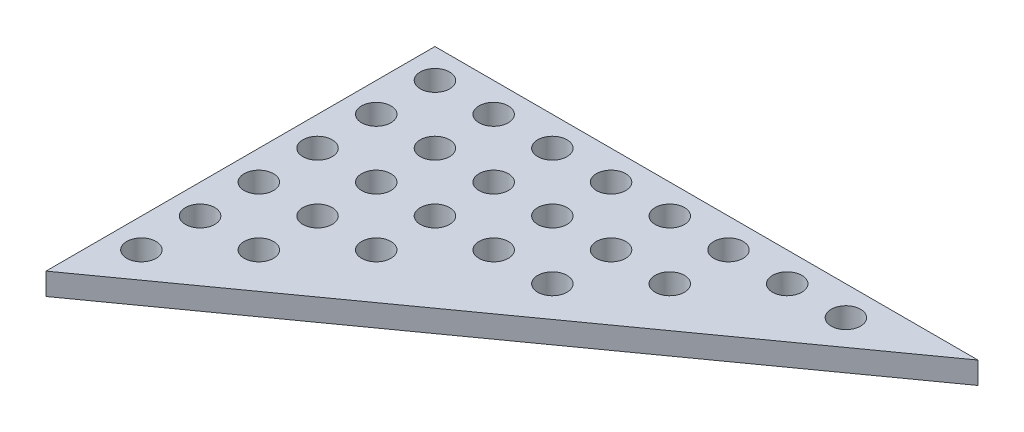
ISO-10303-21;
HEADER;
FILE_DESCRIPTION(('STEP AP214'),'2;1');
FILE_NAME('part.step','',(''),(''),'','','');
FILE_SCHEMA(('AUTOMOTIVE_DESIGN { 1 0 10303 214 1 1 1 1 }'));
ENDSEC;
DATA;
#1=APPLICATION_CONTEXT('core data for automotive mechanical design processes');
#2=APPLICATION_PROTOCOL_DEFINITION('international standard','automotive_design',2000,#1);
#3=PRODUCT_CONTEXT('',#1,'mechanical');
#4=PRODUCT('Part','Part','',(#3));
#5=PRODUCT_RELATED_PRODUCT_CATEGORY('part','',(#4));
#6=PRODUCT_DEFINITION_FORMATION('','',#4);
#7=PRODUCT_DEFINITION_CONTEXT('part definition',#1,'design');
#8=PRODUCT_DEFINITION('design','',#6,#7);
#9=PRODUCT_DEFINITION_SHAPE('','',#8);
#10=(LENGTH_UNIT() NAMED_UNIT(*) SI_UNIT(.MILLI.,.METRE.));
#11=(NAMED_UNIT(*) PLANE_ANGLE_UNIT() SI_UNIT($,.RADIAN.));
#12=(NAMED_UNIT(*) SI_UNIT($,.STERADIAN.) SOLID_ANGLE_UNIT());
#13=UNCERTAINTY_MEASURE_WITH_UNIT(LENGTH_MEASURE(1.E-05),#10,'distance_accuracy_value','');
#14=(GEOMETRIC_REPRESENTATION_CONTEXT(3) GLOBAL_UNCERTAINTY_ASSIGNED_CONTEXT((#13)) GLOBAL_UNIT_ASSIGNED_CONTEXT((#10,
#11,#12)) REPRESENTATION_CONTEXT('',''));
#15=CARTESIAN_POINT('',(0.,0.,0.));
#16=DIRECTION('',(0.,0.,1.));
#17=DIRECTION('',(1.,0.,0.));
#18=AXIS2_PLACEMENT_3D('',#15,#16,#17);
#19=CARTESIAN_POINT('',(0.,3.,0.));
#20=DIRECTION('',(0.,1.,0.));
#21=DIRECTION('',(0.,0.,1.));
#22=AXIS2_PLACEMENT_3D('',#19,#20,#21);
#23=PLANE('',#22);
#24=CARTESIAN_POINT('',(-49.9437499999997,3.,1.053125));
#25=DIRECTION('',(0.,1.,0.));
#26=DIRECTION('',(0.,0.,1.));
#27=AXIS2_PLACEMENT_3D('',#24,#25,#26);
#28=CIRCLE('',#27,2.);
#29=CARTESIAN_POINT('',(-49.9437499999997,3.,3.053125));
#30=VERTEX_POINT('',#29);
#31=EDGE_CURVE('E204',#30,#30,#28,.T.);
#32=ORIENTED_EDGE('',*,*,#31,.F.);
#33=EDGE_LOOP('',(#32));
#34=FACE_BOUND('',#33,.T.);
#35=CARTESIAN_POINT('',(-49.9437499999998,3.,-6.946875));
#36=DIRECTION('',(0.,1.,0.));
#37=DIRECTION('',(0.,0.,1.));
#38=AXIS2_PLACEMENT_3D('',#35,#36,#37);
#39=CIRCLE('',#38,2.);
#40=CARTESIAN_POINT('',(-49.9437499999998,3.,-4.946875));
#41=VERTEX_POINT('',#40);
#42=EDGE_CURVE('E212',#41,#41,#39,.T.);
#43=ORIENTED_EDGE('',*,*,#42,.F.);
#44=EDGE_LOOP('',(#43));
#45=FACE_BOUND('',#44,.T.);
#46=CARTESIAN_POINT('',(-49.9437499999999,3.,-14.946875));
#47=DIRECTION('',(0.,1.,0.));
#48=DIRECTION('',(0.,0.,1.));
#49=AXIS2_PLACEMENT_3D('',#46,#47,#48);
#50=CIRCLE('',#49,2.);
#51=CARTESIAN_POINT('',(-49.9437499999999,3.,-12.946875));
#52=VERTEX_POINT('',#51);
#53=EDGE_CURVE('E220',#52,#52,#50,.T.);
#54=ORIENTED_EDGE('',*,*,#53,.F.);
#55=EDGE_LOOP('',(#54));
#56=FACE_BOUND('',#55,.T.);
#57=CARTESIAN_POINT('',(-17.94375,3.,-22.946875));
#58=DIRECTION('',(0.,1.,0.));
#59=DIRECTION('',(0.,0.,1.));
#60=AXIS2_PLACEMENT_3D('',#57,#58,#59);
#61=CIRCLE('',#60,2.);
#62=CARTESIAN_POINT('',(-17.94375,3.,-20.946875));
#63=VERTEX_POINT('',#62);
#64=EDGE_CURVE('E228',#63,#63,#61,.T.);
#65=ORIENTED_EDGE('',*,*,#64,.F.);
#66=EDGE_LOOP('',(#65));
#67=FACE_BOUND('',#66,.T.);
#68=CARTESIAN_POINT('',(-33.94375,3.,-22.946875));
#69=DIRECTION('',(0.,1.,0.));
#70=DIRECTION('',(0.,0.,1.));
#71=AXIS2_PLACEMENT_3D('',#68,#69,#70);
#72=CIRCLE('',#71,2.);
#73=CARTESIAN_POINT('',(-33.94375,3.,-20.946875));
#74=VERTEX_POINT('',#73);
#75=EDGE_CURVE('E236',#74,#74,#72,.T.);
#76=ORIENTED_EDGE('',*,*,#75,.F.);
#77=EDGE_LOOP('',(#76));
#78=FACE_BOUND('',#77,.T.);
#79=CARTESIAN_POINT('',(-49.94375,3.,-22.946875));
#80=DIRECTION('',(0.,1.,0.));
#81=DIRECTION('',(0.,0.,1.));
#82=AXIS2_PLACEMENT_3D('',#79,#80,#81);
#83=CIRCLE('',#82,2.);
#84=CARTESIAN_POINT('',(-49.94375,3.,-20.946875));
#85=VERTEX_POINT('',#84);
#86=EDGE_CURVE('E244',#85,#85,#83,.T.);
#87=ORIENTED_EDGE('',*,*,#86,.F.);
#88=EDGE_LOOP('',(#87));
#89=FACE_BOUND('',#88,.T.);
#90=CARTESIAN_POINT('',(-57.9437499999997,3.,1.053125));
#91=DIRECTION('',(0.,1.,0.));
#92=DIRECTION('',(0.,0.,1.));
#93=AXIS2_PLACEMENT_3D('',#90,#91,#92);
#94=CIRCLE('',#93,2.);
#95=CARTESIAN_POINT('',(-57.9437499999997,3.,3.053125));
#96=VERTEX_POINT('',#95);
#97=EDGE_CURVE('E252',#96,#96,#94,.T.);
#98=ORIENTED_EDGE('',*,*,#97,.F.);
#99=EDGE_LOOP('',(#98));
#100=FACE_BOUND('',#99,.T.);
#101=CARTESIAN_POINT('',(-57.9437499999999,3.,-14.946875));
#102=DIRECTION('',(0.,1.,0.));
#103=DIRECTION('',(0.,0.,1.));
#104=AXIS2_PLACEMENT_3D('',#101,#102,#103);
#105=CIRCLE('',#104,2.);
#106=CARTESIAN_POINT('',(-57.9437499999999,3.,-12.946875));
#107=VERTEX_POINT('',#106);
#108=EDGE_CURVE('E260',#107,#107,#105,.T.);
#109=ORIENTED_EDGE('',*,*,#108,.F.);
#110=EDGE_LOOP('',(#109));
#111=FACE_BOUND('',#110,.T.);
#112=CARTESIAN_POINT('',(-1.94375000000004,3.,-30.946875));
#113=DIRECTION('',(0.,1.,0.));
#114=DIRECTION('',(0.,0.,1.));
#115=AXIS2_PLACEMENT_3D('',#112,#113,#114);
#116=CIRCLE('',#115,2.);
#117=CARTESIAN_POINT('',(-1.94375000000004,3.,-28.946875));
#118=VERTEX_POINT('',#117);
#119=EDGE_CURVE('E268',#118,#118,#116,.T.);
#120=ORIENTED_EDGE('',*,*,#119,.F.);
#121=EDGE_LOOP('',(#120));
#122=FACE_BOUND('',#121,.T.);
#123=CARTESIAN_POINT('',(-17.94375,3.,-30.946875));
#124=DIRECTION('',(0.,1.,0.));
#125=DIRECTION('',(0.,0.,1.));
#126=AXIS2_PLACEMENT_3D('',#123,#124,#125);
#127=CIRCLE('',#126,2.);
#128=CARTESIAN_POINT('',(-17.94375,3.,-28.946875));
#129=VERTEX_POINT('',#128);
#130=EDGE_CURVE('E276',#129,#129,#127,.T.);
#131=ORIENTED_EDGE('',*,*,#130,.F.);
#132=EDGE_LOOP('',(#131));
#133=FACE_BOUND('',#132,.T.);
#134=CARTESIAN_POINT('',(-33.94375,3.,-30.946875));
#135=DIRECTION('',(0.,1.,0.));
#136=DIRECTION('',(0.,0.,1.));
#137=AXIS2_PLACEMENT_3D('',#134,#135,#136);
#138=CIRCLE('',#137,2.);
#139=CARTESIAN_POINT('',(-33.94375,3.,-28.946875));
#140=VERTEX_POINT('',#139);
#141=EDGE_CURVE('E284',#140,#140,#138,.T.);
#142=ORIENTED_EDGE('',*,*,#141,.F.);
#143=EDGE_LOOP('',(#142));
#144=FACE_BOUND('',#143,.T.);
#145=CARTESIAN_POINT('',(-49.94375,3.,-30.946875));
#146=DIRECTION('',(0.,1.,0.));
#147=DIRECTION('',(0.,0.,1.));
#148=AXIS2_PLACEMENT_3D('',#145,#146,#147);
#149=CIRCLE('',#148,2.);
#150=CARTESIAN_POINT('',(-49.94375,3.,-28.946875));
#151=VERTEX_POINT('',#150);
#152=EDGE_CURVE('E292',#151,#151,#149,.T.);
#153=ORIENTED_EDGE('',*,*,#152,.F.);
#154=EDGE_LOOP('',(#153));
#155=FACE_BOUND('',#154,.T.);
#156=DIRECTION('',(-1.,0.,0.));
#157=VECTOR('',#156,1.);
#158=CARTESIAN_POINT('',(12.05625,3.,-34.946875));
#159=LINE('',#158,#157);
#160=CARTESIAN_POINT('',(12.05625,3.,-34.946875));
#161=VERTEX_POINT('',#160);
#162=CARTESIAN_POINT('',(-61.94375,3.,-34.946875));
#163=VERTEX_POINT('',#162);
#164=EDGE_CURVE('E76',#161,#163,#159,.T.);
#165=ORIENTED_EDGE('',*,*,#164,.T.);
#166=DIRECTION('',(0.,0.,1.));
#167=VECTOR('',#166,1.);
#168=CARTESIAN_POINT('',(-61.94375,3.,-34.946875));
#169=LINE('',#168,#167);
#170=CARTESIAN_POINT('',(-61.94375,3.,18.053125));
#171=VERTEX_POINT('',#170);
#172=EDGE_CURVE('E72',#163,#171,#169,.T.);
#173=ORIENTED_EDGE('',*,*,#172,.T.);
#174=DIRECTION('',(0.812990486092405,0.,-0.582276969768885));
#175=VECTOR('',#174,1.);
#176=CARTESIAN_POINT('',(-61.94375,3.,18.053125));
#177=LINE('',#176,#175);
#178=EDGE_CURVE('E52',#171,#161,#177,.T.);
#179=ORIENTED_EDGE('',*,*,#178,.T.);
#180=EDGE_LOOP('',(#165,#173,#179));
#181=FACE_BOUND('',#180,.T.);
#182=CARTESIAN_POINT('',(-57.94375,3.,-30.946875));
#183=DIRECTION('',(0.,1.,0.));
#184=DIRECTION('',(0.,0.,1.));
#185=AXIS2_PLACEMENT_3D('',#182,#183,#184);
#186=CIRCLE('',#185,2.);
#187=CARTESIAN_POINT('',(-57.94375,3.,-28.946875));
#188=VERTEX_POINT('',#187);
#189=EDGE_CURVE('E86',#188,#188,#186,.T.);
#190=ORIENTED_EDGE('',*,*,#189,.F.);
#191=EDGE_LOOP('',(#190));
#192=FACE_BOUND('',#191,.T.);
#193=CARTESIAN_POINT('',(-41.94375,3.,-30.946875));
#194=DIRECTION('',(0.,1.,0.));
#195=DIRECTION('',(0.,0.,1.));
#196=AXIS2_PLACEMENT_3D('',#193,#194,#195);
#197=CIRCLE('',#196,2.);
#198=CARTESIAN_POINT('',(-41.94375,3.,-28.946875));
#199=VERTEX_POINT('',#198);
#200=EDGE_CURVE('E288',#199,#199,#197,.T.);
#201=ORIENTED_EDGE('',*,*,#200,.F.);
#202=EDGE_LOOP('',(#201));
#203=FACE_BOUND('',#202,.T.);
#204=CARTESIAN_POINT('',(-25.94375,3.,-30.946875));
#205=DIRECTION('',(0.,1.,0.));
#206=DIRECTION('',(0.,0.,1.));
#207=AXIS2_PLACEMENT_3D('',#204,#205,#206);
#208=CIRCLE('',#207,2.);
#209=CARTESIAN_POINT('',(-25.94375,3.,-28.946875));
#210=VERTEX_POINT('',#209);
#211=EDGE_CURVE('E280',#210,#210,#208,.T.);
#212=ORIENTED_EDGE('',*,*,#211,.F.);
#213=EDGE_LOOP('',(#212));
#214=FACE_BOUND('',#213,.T.);
#215=CARTESIAN_POINT('',(-9.94375000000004,3.,-30.946875));
#216=DIRECTION('',(0.,1.,0.));
#217=DIRECTION('',(0.,0.,1.));
#218=AXIS2_PLACEMENT_3D('',#215,#216,#217);
#219=CIRCLE('',#218,2.);
#220=CARTESIAN_POINT('',(-9.94375000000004,3.,-28.946875));
#221=VERTEX_POINT('',#220);
#222=EDGE_CURVE('E272',#221,#221,#219,.T.);
#223=ORIENTED_EDGE('',*,*,#222,.F.);
#224=EDGE_LOOP('',(#223));
#225=FACE_BOUND('',#224,.T.);
#226=CARTESIAN_POINT('',(-57.94375,3.,-22.946875));
#227=DIRECTION('',(0.,1.,0.));
#228=DIRECTION('',(0.,0.,1.));
#229=AXIS2_PLACEMENT_3D('',#226,#227,#228);
#230=CIRCLE('',#229,2.);
#231=CARTESIAN_POINT('',(-57.94375,3.,-20.946875));
#232=VERTEX_POINT('',#231);
#233=EDGE_CURVE('E264',#232,#232,#230,.T.);
#234=ORIENTED_EDGE('',*,*,#233,.F.);
#235=EDGE_LOOP('',(#234));
#236=FACE_BOUND('',#235,.T.);
#237=CARTESIAN_POINT('',(-57.9437499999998,3.,-6.946875));
#238=DIRECTION('',(0.,1.,0.));
#239=DIRECTION('',(0.,0.,1.));
#240=AXIS2_PLACEMENT_3D('',#237,#238,#239);
#241=CIRCLE('',#240,2.);
#242=CARTESIAN_POINT('',(-57.9437499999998,3.,-4.946875));
#243=VERTEX_POINT('',#242);
#244=EDGE_CURVE('E256',#243,#243,#241,.T.);
#245=ORIENTED_EDGE('',*,*,#244,.F.);
#246=EDGE_LOOP('',(#245));
#247=FACE_BOUND('',#246,.T.);
#248=CARTESIAN_POINT('',(-57.9437499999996,3.,9.053125));
#249=DIRECTION('',(0.,1.,0.));
#250=DIRECTION('',(0.,0.,1.));
#251=AXIS2_PLACEMENT_3D('',#248,#249,#250);
#252=CIRCLE('',#251,2.);
#253=CARTESIAN_POINT('',(-57.9437499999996,3.,11.053125));
#254=VERTEX_POINT('',#253);
#255=EDGE_CURVE('E248',#254,#254,#252,.T.);
#256=ORIENTED_EDGE('',*,*,#255,.F.);
#257=EDGE_LOOP('',(#256));
#258=FACE_BOUND('',#257,.T.);
#259=CARTESIAN_POINT('',(-41.94375,3.,-22.946875));
#260=DIRECTION('',(0.,1.,0.));
#261=DIRECTION('',(0.,0.,1.));
#262=AXIS2_PLACEMENT_3D('',#259,#260,#261);
#263=CIRCLE('',#262,2.);
#264=CARTESIAN_POINT('',(-41.94375,3.,-20.946875));
#265=VERTEX_POINT('',#264);
#266=EDGE_CURVE('E240',#265,#265,#263,.T.);
#267=ORIENTED_EDGE('',*,*,#266,.F.);
#268=EDGE_LOOP('',(#267));
#269=FACE_BOUND('',#268,.T.);
#270=CARTESIAN_POINT('',(-25.94375,3.,-22.946875));
#271=DIRECTION('',(0.,1.,0.));
#272=DIRECTION('',(0.,0.,1.));
#273=AXIS2_PLACEMENT_3D('',#270,#271,#272);
#274=CIRCLE('',#273,2.);
#275=CARTESIAN_POINT('',(-25.94375,3.,-20.946875));
#276=VERTEX_POINT('',#275);
#277=EDGE_CURVE('E232',#276,#276,#274,.T.);
#278=ORIENTED_EDGE('',*,*,#277,.F.);
#279=EDGE_LOOP('',(#278));
#280=FACE_BOUND('',#279,.T.);
#281=CARTESIAN_POINT('',(-33.9437499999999,3.,-14.946875));
#282=DIRECTION('',(0.,1.,0.));
#283=DIRECTION('',(0.,0.,1.));
#284=AXIS2_PLACEMENT_3D('',#281,#282,#283);
#285=CIRCLE('',#284,2.);
#286=CARTESIAN_POINT('',(-33.9437499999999,3.,-12.946875));
#287=VERTEX_POINT('',#286);
#288=EDGE_CURVE('E224',#287,#287,#285,.T.);
#289=ORIENTED_EDGE('',*,*,#288,.F.);
#290=EDGE_LOOP('',(#289));
#291=FACE_BOUND('',#290,.T.);
#292=CARTESIAN_POINT('',(-41.9437499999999,3.,-14.946875));
#293=DIRECTION('',(0.,1.,0.));
#294=DIRECTION('',(0.,0.,1.));
#295=AXIS2_PLACEMENT_3D('',#292,#293,#294);
#296=CIRCLE('',#295,2.);
#297=CARTESIAN_POINT('',(-41.9437499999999,3.,-12.946875));
#298=VERTEX_POINT('',#297);
#299=EDGE_CURVE('E216',#298,#298,#296,.T.);
#300=ORIENTED_EDGE('',*,*,#299,.F.);
#301=EDGE_LOOP('',(#300));
#302=FACE_BOUND('',#301,.T.);
#303=CARTESIAN_POINT('',(-41.9437499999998,3.,-6.946875));
#304=DIRECTION('',(0.,1.,0.));
#305=DIRECTION('',(0.,0.,1.));
#306=AXIS2_PLACEMENT_3D('',#303,#304,#305);
#307=CIRCLE('',#306,2.);
#308=CARTESIAN_POINT('',(-41.9437499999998,3.,-4.946875));
#309=VERTEX_POINT('',#308);
#310=EDGE_CURVE('E208',#309,#309,#307,.T.);
#311=ORIENTED_EDGE('',*,*,#310,.F.);
#312=EDGE_LOOP('',(#311));
#313=FACE_BOUND('',#312,.T.);
#314=CARTESIAN_POINT('',(-25.9437499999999,3.,-14.946875));
#315=DIRECTION('',(0.,1.,0.));
#316=DIRECTION('',(0.,0.,1.));
#317=AXIS2_PLACEMENT_3D('',#314,#315,#316);
#318=CIRCLE('',#317,2.);
#319=CARTESIAN_POINT('',(-25.9437499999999,3.,-12.946875));
#320=VERTEX_POINT('',#319);
#321=EDGE_CURVE('E199',#320,#320,#318,.T.);
#322=ORIENTED_EDGE('',*,*,#321,.F.);
#323=EDGE_LOOP('',(#322));
#324=FACE_BOUND('',#323,.T.);
#325=ADVANCED_FACE('F35',(#34,#45,#56,#67,#78,#89,#100,#111,#122,#133,#144,#155,#181,#192,#203,
#214,#225,#236,#247,#258,#269,#280,#291,#302,#313,#324),#23,.T.);
#326=CARTESIAN_POINT('',(0.,0.,0.));
#327=DIRECTION('',(0.,1.,0.));
#328=DIRECTION('',(0.,0.,1.));
#329=AXIS2_PLACEMENT_3D('',#326,#327,#328);
#330=PLANE('',#329);
#331=DIRECTION('',(-1.,0.,0.));
#332=VECTOR('',#331,1.);
#333=CARTESIAN_POINT('',(12.05625,0.,-34.946875));
#334=LINE('',#333,#332);
#335=CARTESIAN_POINT('',(12.05625,0.,-34.946875));
#336=VERTEX_POINT('',#335);
#337=CARTESIAN_POINT('',(-61.94375,0.,-34.946875));
#338=VERTEX_POINT('',#337);
#339=EDGE_CURVE('E83',#336,#338,#334,.T.);
#340=ORIENTED_EDGE('',*,*,#339,.F.);
#341=DIRECTION('',(0.812990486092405,0.,-0.582276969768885));
#342=VECTOR('',#341,1.);
#343=CARTESIAN_POINT('',(-61.94375,0.,18.053125));
#344=LINE('',#343,#342);
#345=CARTESIAN_POINT('',(-61.94375,0.,18.053125));
#346=VERTEX_POINT('',#345);
#347=EDGE_CURVE('E69',#346,#336,#344,.T.);
#348=ORIENTED_EDGE('',*,*,#347,.F.);
#349=DIRECTION('',(0.,0.,1.));
#350=VECTOR('',#349,1.);
#351=CARTESIAN_POINT('',(-61.94375,0.,-34.946875));
#352=LINE('',#351,#350);
#353=EDGE_CURVE('E64',#338,#346,#352,.T.);
#354=ORIENTED_EDGE('',*,*,#353,.F.);
#355=EDGE_LOOP('',(#340,#348,#354));
#356=FACE_BOUND('',#355,.T.);
#357=CARTESIAN_POINT('',(-57.94375,0.,-30.946875));
#358=DIRECTION('',(0.,1.,0.));
#359=DIRECTION('',(0.,0.,1.));
#360=AXIS2_PLACEMENT_3D('',#357,#358,#359);
#361=CIRCLE('',#360,2.);
#362=CARTESIAN_POINT('',(-57.94375,0.,-28.946875));
#363=VERTEX_POINT('',#362);
#364=EDGE_CURVE('E90',#363,#363,#361,.T.);
#365=ORIENTED_EDGE('',*,*,#364,.T.);
#366=EDGE_LOOP('',(#365));
#367=FACE_BOUND('',#366,.T.);
#368=CARTESIAN_POINT('',(-49.94375,0.,-30.946875));
#369=DIRECTION('',(0.,1.,0.));
#370=DIRECTION('',(0.,0.,1.));
#371=AXIS2_PLACEMENT_3D('',#368,#369,#370);
#372=CIRCLE('',#371,2.);
#373=CARTESIAN_POINT('',(-49.94375,0.,-28.946875));
#374=VERTEX_POINT('',#373);
#375=EDGE_CURVE('E106',#374,#374,#372,.T.);
#376=ORIENTED_EDGE('',*,*,#375,.T.);
#377=EDGE_LOOP('',(#376));
#378=FACE_BOUND('',#377,.T.);
#379=CARTESIAN_POINT('',(-41.94375,0.,-30.946875));
#380=DIRECTION('',(0.,1.,0.));
#381=DIRECTION('',(0.,0.,1.));
#382=AXIS2_PLACEMENT_3D('',#379,#380,#381);
#383=CIRCLE('',#382,2.);
#384=CARTESIAN_POINT('',(-41.94375,0.,-28.946875));
#385=VERTEX_POINT('',#384);
#386=EDGE_CURVE('E110',#385,#385,#383,.T.);
#387=ORIENTED_EDGE('',*,*,#386,.T.);
#388=EDGE_LOOP('',(#387));
#389=FACE_BOUND('',#388,.T.);
#390=CARTESIAN_POINT('',(-33.94375,0.,-30.946875));
#391=DIRECTION('',(0.,1.,0.));
#392=DIRECTION('',(0.,0.,1.));
#393=AXIS2_PLACEMENT_3D('',#390,#391,#392);
#394=CIRCLE('',#393,2.);
#395=CARTESIAN_POINT('',(-33.94375,0.,-28.946875));
#396=VERTEX_POINT('',#395);
#397=EDGE_CURVE('E114',#396,#396,#394,.T.);
#398=ORIENTED_EDGE('',*,*,#397,.T.);
#399=EDGE_LOOP('',(#398));
#400=FACE_BOUND('',#399,.T.);
#401=CARTESIAN_POINT('',(-25.94375,0.,-30.946875));
#402=DIRECTION('',(0.,1.,0.));
#403=DIRECTION('',(0.,0.,1.));
#404=AXIS2_PLACEMENT_3D('',#401,#402,#403);
#405=CIRCLE('',#404,2.);
#406=CARTESIAN_POINT('',(-25.94375,0.,-28.946875));
#407=VERTEX_POINT('',#406);
#408=EDGE_CURVE('E118',#407,#407,#405,.T.);
#409=ORIENTED_EDGE('',*,*,#408,.T.);
#410=EDGE_LOOP('',(#409));
#411=FACE_BOUND('',#410,.T.);
#412=CARTESIAN_POINT('',(-17.94375,0.,-30.946875));
#413=DIRECTION('',(0.,1.,0.));
#414=DIRECTION('',(0.,0.,1.));
#415=AXIS2_PLACEMENT_3D('',#412,#413,#414);
#416=CIRCLE('',#415,2.);
#417=CARTESIAN_POINT('',(-17.94375,0.,-28.946875));
#418=VERTEX_POINT('',#417);
#419=EDGE_CURVE('E122',#418,#418,#416,.T.);
#420=ORIENTED_EDGE('',*,*,#419,.T.);
#421=EDGE_LOOP('',(#420));
#422=FACE_BOUND('',#421,.T.);
#423=CARTESIAN_POINT('',(-9.94375000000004,0.,-30.946875));
#424=DIRECTION('',(0.,1.,0.));
#425=DIRECTION('',(0.,0.,1.));
#426=AXIS2_PLACEMENT_3D('',#423,#424,#425);
#427=CIRCLE('',#426,2.);
#428=CARTESIAN_POINT('',(-9.94375000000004,0.,-28.946875));
#429=VERTEX_POINT('',#428);
#430=EDGE_CURVE('E126',#429,#429,#427,.T.);
#431=ORIENTED_EDGE('',*,*,#430,.T.);
#432=EDGE_LOOP('',(#431));
#433=FACE_BOUND('',#432,.T.);
#434=CARTESIAN_POINT('',(-1.94375000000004,0.,-30.946875));
#435=DIRECTION('',(0.,1.,0.));
#436=DIRECTION('',(0.,0.,1.));
#437=AXIS2_PLACEMENT_3D('',#434,#435,#436);
#438=CIRCLE('',#437,2.);
#439=CARTESIAN_POINT('',(-1.94375000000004,0.,-28.946875));
#440=VERTEX_POINT('',#439);
#441=EDGE_CURVE('E130',#440,#440,#438,.T.);
#442=ORIENTED_EDGE('',*,*,#441,.T.);
#443=EDGE_LOOP('',(#442));
#444=FACE_BOUND('',#443,.T.);
#445=CARTESIAN_POINT('',(-57.94375,0.,-22.946875));
#446=DIRECTION('',(0.,1.,0.));
#447=DIRECTION('',(0.,0.,1.));
#448=AXIS2_PLACEMENT_3D('',#445,#446,#447);
#449=CIRCLE('',#448,2.);
#450=CARTESIAN_POINT('',(-57.94375,0.,-20.946875));
#451=VERTEX_POINT('',#450);
#452=EDGE_CURVE('E134',#451,#451,#449,.T.);
#453=ORIENTED_EDGE('',*,*,#452,.T.);
#454=EDGE_LOOP('',(#453));
#455=FACE_BOUND('',#454,.T.);
#456=CARTESIAN_POINT('',(-57.9437499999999,0.,-14.946875));
#457=DIRECTION('',(0.,1.,0.));
#458=DIRECTION('',(0.,0.,1.));
#459=AXIS2_PLACEMENT_3D('',#456,#457,#458);
#460=CIRCLE('',#459,2.);
#461=CARTESIAN_POINT('',(-57.9437499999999,0.,-12.946875));
#462=VERTEX_POINT('',#461);
#463=EDGE_CURVE('E138',#462,#462,#460,.T.);
#464=ORIENTED_EDGE('',*,*,#463,.T.);
#465=EDGE_LOOP('',(#464));
#466=FACE_BOUND('',#465,.T.);
#467=CARTESIAN_POINT('',(-57.9437499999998,0.,-6.946875));
#468=DIRECTION('',(0.,1.,0.));
#469=DIRECTION('',(0.,0.,1.));
#470=AXIS2_PLACEMENT_3D('',#467,#468,#469);
#471=CIRCLE('',#470,2.);
#472=CARTESIAN_POINT('',(-57.9437499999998,0.,-4.946875));
#473=VERTEX_POINT('',#472);
#474=EDGE_CURVE('E142',#473,#473,#471,.T.);
#475=ORIENTED_EDGE('',*,*,#474,.T.);
#476=EDGE_LOOP('',(#475));
#477=FACE_BOUND('',#476,.T.);
#478=CARTESIAN_POINT('',(-57.9437499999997,0.,1.053125));
#479=DIRECTION('',(0.,1.,0.));
#480=DIRECTION('',(0.,0.,1.));
#481=AXIS2_PLACEMENT_3D('',#478,#479,#480);
#482=CIRCLE('',#481,2.);
#483=CARTESIAN_POINT('',(-57.9437499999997,0.,3.053125));
#484=VERTEX_POINT('',#483);
#485=EDGE_CURVE('E146',#484,#484,#482,.T.);
#486=ORIENTED_EDGE('',*,*,#485,.T.);
#487=EDGE_LOOP('',(#486));
#488=FACE_BOUND('',#487,.T.);
#489=CARTESIAN_POINT('',(-57.9437499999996,0.,9.053125));
#490=DIRECTION('',(0.,1.,0.));
#491=DIRECTION('',(0.,0.,1.));
#492=AXIS2_PLACEMENT_3D('',#489,#490,#491);
#493=CIRCLE('',#492,2.);
#494=CARTESIAN_POINT('',(-57.9437499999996,0.,11.053125));
#495=VERTEX_POINT('',#494);
#496=EDGE_CURVE('E150',#495,#495,#493,.T.);
#497=ORIENTED_EDGE('',*,*,#496,.T.);
#498=EDGE_LOOP('',(#497));
#499=FACE_BOUND('',#498,.T.);
#500=CARTESIAN_POINT('',(-49.94375,0.,-22.946875));
#501=DIRECTION('',(0.,1.,0.));
#502=DIRECTION('',(0.,0.,1.));
#503=AXIS2_PLACEMENT_3D('',#500,#501,#502);
#504=CIRCLE('',#503,2.);
#505=CARTESIAN_POINT('',(-49.94375,0.,-20.946875));
#506=VERTEX_POINT('',#505);
#507=EDGE_CURVE('E154',#506,#506,#504,.T.);
#508=ORIENTED_EDGE('',*,*,#507,.T.);
#509=EDGE_LOOP('',(#508));
#510=FACE_BOUND('',#509,.T.);
#511=CARTESIAN_POINT('',(-41.94375,0.,-22.946875));
#512=DIRECTION('',(0.,1.,0.));
#513=DIRECTION('',(0.,0.,1.));
#514=AXIS2_PLACEMENT_3D('',#511,#512,#513);
#515=CIRCLE('',#514,2.);
#516=CARTESIAN_POINT('',(-41.94375,0.,-20.946875));
#517=VERTEX_POINT('',#516);
#518=EDGE_CURVE('E158',#517,#517,#515,.T.);
#519=ORIENTED_EDGE('',*,*,#518,.T.);
#520=EDGE_LOOP('',(#519));
#521=FACE_BOUND('',#520,.T.);
#522=CARTESIAN_POINT('',(-33.94375,0.,-22.946875));
#523=DIRECTION('',(0.,1.,0.));
#524=DIRECTION('',(0.,0.,1.));
#525=AXIS2_PLACEMENT_3D('',#522,#523,#524);
#526=CIRCLE('',#525,2.);
#527=CARTESIAN_POINT('',(-33.94375,0.,-20.946875));
#528=VERTEX_POINT('',#527);
#529=EDGE_CURVE('E162',#528,#528,#526,.T.);
#530=ORIENTED_EDGE('',*,*,#529,.T.);
#531=EDGE_LOOP('',(#530));
#532=FACE_BOUND('',#531,.T.);
#533=CARTESIAN_POINT('',(-25.94375,0.,-22.946875));
#534=DIRECTION('',(0.,1.,0.));
#535=DIRECTION('',(0.,0.,1.));
#536=AXIS2_PLACEMENT_3D('',#533,#534,#535);
#537=CIRCLE('',#536,2.);
#538=CARTESIAN_POINT('',(-25.94375,0.,-20.946875));
#539=VERTEX_POINT('',#538);
#540=EDGE_CURVE('E166',#539,#539,#537,.T.);
#541=ORIENTED_EDGE('',*,*,#540,.T.);
#542=EDGE_LOOP('',(#541));
#543=FACE_BOUND('',#542,.T.);
#544=CARTESIAN_POINT('',(-17.94375,0.,-22.946875));
#545=DIRECTION('',(0.,1.,0.));
#546=DIRECTION('',(0.,0.,1.));
#547=AXIS2_PLACEMENT_3D('',#544,#545,#546);
#548=CIRCLE('',#547,2.);
#549=CARTESIAN_POINT('',(-17.94375,0.,-20.946875));
#550=VERTEX_POINT('',#549);
#551=EDGE_CURVE('E170',#550,#550,#548,.T.);
#552=ORIENTED_EDGE('',*,*,#551,.T.);
#553=EDGE_LOOP('',(#552));
#554=FACE_BOUND('',#553,.T.);
#555=CARTESIAN_POINT('',(-33.9437499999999,0.,-14.946875));
#556=DIRECTION('',(0.,1.,0.));
#557=DIRECTION('',(0.,0.,1.));
#558=AXIS2_PLACEMENT_3D('',#555,#556,#557);
#559=CIRCLE('',#558,2.);
#560=CARTESIAN_POINT('',(-33.9437499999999,0.,-12.946875));
#561=VERTEX_POINT('',#560);
#562=EDGE_CURVE('E174',#561,#561,#559,.T.);
#563=ORIENTED_EDGE('',*,*,#562,.T.);
#564=EDGE_LOOP('',(#563));
#565=FACE_BOUND('',#564,.T.);
#566=CARTESIAN_POINT('',(-49.9437499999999,0.,-14.946875));
#567=DIRECTION('',(0.,1.,0.));
#568=DIRECTION('',(0.,0.,1.));
#569=AXIS2_PLACEMENT_3D('',#566,#567,#568);
#570=CIRCLE('',#569,2.);
#571=CARTESIAN_POINT('',(-49.9437499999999,0.,-12.946875));
#572=VERTEX_POINT('',#571);
#573=EDGE_CURVE('E178',#572,#572,#570,.T.);
#574=ORIENTED_EDGE('',*,*,#573,.T.);
#575=EDGE_LOOP('',(#574));
#576=FACE_BOUND('',#575,.T.);
#577=CARTESIAN_POINT('',(-41.9437499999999,0.,-14.946875));
#578=DIRECTION('',(0.,1.,0.));
#579=DIRECTION('',(0.,0.,1.));
#580=AXIS2_PLACEMENT_3D('',#577,#578,#579);
#581=CIRCLE('',#580,2.);
#582=CARTESIAN_POINT('',(-41.9437499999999,0.,-12.946875));
#583=VERTEX_POINT('',#582);
#584=EDGE_CURVE('E182',#583,#583,#581,.T.);
#585=ORIENTED_EDGE('',*,*,#584,.T.);
#586=EDGE_LOOP('',(#585));
#587=FACE_BOUND('',#586,.T.);
#588=CARTESIAN_POINT('',(-49.9437499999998,0.,-6.946875));
#589=DIRECTION('',(0.,1.,0.));
#590=DIRECTION('',(0.,0.,1.));
#591=AXIS2_PLACEMENT_3D('',#588,#589,#590);
#592=CIRCLE('',#591,2.);
#593=CARTESIAN_POINT('',(-49.9437499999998,0.,-4.946875));
#594=VERTEX_POINT('',#593);
#595=EDGE_CURVE('E186',#594,#594,#592,.T.);
#596=ORIENTED_EDGE('',*,*,#595,.T.);
#597=EDGE_LOOP('',(#596));
#598=FACE_BOUND('',#597,.T.);
#599=CARTESIAN_POINT('',(-41.9437499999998,0.,-6.946875));
#600=DIRECTION('',(0.,1.,0.));
#601=DIRECTION('',(0.,0.,1.));
#602=AXIS2_PLACEMENT_3D('',#599,#600,#601);
#603=CIRCLE('',#602,2.);
#604=CARTESIAN_POINT('',(-41.9437499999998,0.,-4.946875));
#605=VERTEX_POINT('',#604);
#606=EDGE_CURVE('E190',#605,#605,#603,.T.);
#607=ORIENTED_EDGE('',*,*,#606,.T.);
#608=EDGE_LOOP('',(#607));
#609=FACE_BOUND('',#608,.T.);
#610=CARTESIAN_POINT('',(-49.9437499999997,0.,1.053125));
#611=DIRECTION('',(0.,1.,0.));
#612=DIRECTION('',(0.,0.,1.));
#613=AXIS2_PLACEMENT_3D('',#610,#611,#612);
#614=CIRCLE('',#613,2.);
#615=CARTESIAN_POINT('',(-49.9437499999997,0.,3.053125));
#616=VERTEX_POINT('',#615);
#617=EDGE_CURVE('E194',#616,#616,#614,.T.);
#618=ORIENTED_EDGE('',*,*,#617,.T.);
#619=EDGE_LOOP('',(#618));
#620=FACE_BOUND('',#619,.T.);
#621=CARTESIAN_POINT('',(-25.9437499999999,0.,-14.946875));
#622=DIRECTION('',(0.,1.,0.));
#623=DIRECTION('',(0.,0.,1.));
#624=AXIS2_PLACEMENT_3D('',#621,#622,#623);
#625=CIRCLE('',#624,2.);
#626=CARTESIAN_POINT('',(-25.9437499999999,0.,-12.946875));
#627=VERTEX_POINT('',#626);
#628=EDGE_CURVE('E197',#627,#627,#625,.T.);
#629=ORIENTED_EDGE('',*,*,#628,.T.);
#630=EDGE_LOOP('',(#629));
#631=FACE_BOUND('',#630,.T.);
#632=ADVANCED_FACE('F96',(#356,#367,#378,#389,#400,#411,#422,#433,#444,#455,#466,#477,#488,#499,
#510,#521,#532,#543,#554,#565,#576,#587,#598,#609,#620,#631),#330,.F.);
#633=CARTESIAN_POINT('',(12.05625,3.,-34.946875));
#634=DIRECTION('',(0.,0.,1.));
#635=DIRECTION('',(1.,0.,0.));
#636=AXIS2_PLACEMENT_3D('',#633,#634,#635);
#637=PLANE('',#636);
#638=ORIENTED_EDGE('',*,*,#339,.T.);
#639=DIRECTION('',(0.,-1.,0.));
#640=VECTOR('',#639,1.);
#641=CARTESIAN_POINT('',(-61.94375,3.,-34.946875));
#642=LINE('',#641,#640);
#643=EDGE_CURVE('E11',#163,#338,#642,.T.);
#644=ORIENTED_EDGE('',*,*,#643,.F.);
#645=ORIENTED_EDGE('',*,*,#164,.F.);
#646=DIRECTION('',(0.,-1.,0.));
#647=VECTOR('',#646,1.);
#648=CARTESIAN_POINT('',(12.05625,3.,-34.946875));
#649=LINE('',#648,#647);
#650=EDGE_CURVE('E84',#161,#336,#649,.T.);
#651=ORIENTED_EDGE('',*,*,#650,.T.);
#652=EDGE_LOOP('',(#638,#644,#645,#651));
#653=FACE_BOUND('',#652,.T.);
#654=ADVANCED_FACE('F37',(#653),#637,.F.);
#655=CARTESIAN_POINT('',(-61.94375,3.,-34.946875));
#656=DIRECTION('',(1.,0.,0.));
#657=DIRECTION('',(0.,0.,-1.));
#658=AXIS2_PLACEMENT_3D('',#655,#656,#657);
#659=PLANE('',#658);
#660=ORIENTED_EDGE('',*,*,#353,.T.);
#661=DIRECTION('',(0.,-1.,0.));
#662=VECTOR('',#661,1.);
#663=CARTESIAN_POINT('',(-61.94375,3.,18.053125));
#664=LINE('',#663,#662);
#665=EDGE_CURVE('E44',#171,#346,#664,.T.);
#666=ORIENTED_EDGE('',*,*,#665,.F.);
#667=ORIENTED_EDGE('',*,*,#172,.F.);
#668=ORIENTED_EDGE('',*,*,#643,.T.);
#669=EDGE_LOOP('',(#660,#666,#667,#668));
#670=FACE_BOUND('',#669,.T.);
#671=ADVANCED_FACE('F73',(#670),#659,.F.);
#672=CARTESIAN_POINT('',(-61.94375,3.,18.053125));
#673=DIRECTION('',(-0.582276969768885,0.,-0.812990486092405));
#674=DIRECTION('',(-0.812990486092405,0.,0.582276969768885));
#675=AXIS2_PLACEMENT_3D('',#672,#673,#674);
#676=PLANE('',#675);
#677=ORIENTED_EDGE('',*,*,#347,.T.);
#678=ORIENTED_EDGE('',*,*,#650,.F.);
#679=ORIENTED_EDGE('',*,*,#178,.F.);
#680=ORIENTED_EDGE('',*,*,#665,.T.);
#681=EDGE_LOOP('',(#677,#678,#679,#680));
#682=FACE_BOUND('',#681,.T.);
#683=ADVANCED_FACE('F95',(#682),#676,.F.);
#684=CARTESIAN_POINT('',(-57.94375,3.,-30.946875));
#685=DIRECTION('',(0.,-1.,0.));
#686=DIRECTION('',(0.,0.,-1.));
#687=AXIS2_PLACEMENT_3D('',#684,#685,#686);
#688=CYLINDRICAL_SURFACE('',#687,2.);
#689=ORIENTED_EDGE('',*,*,#189,.T.);
#690=EDGE_LOOP('',(#689));
#691=FACE_BOUND('',#690,.T.);
#692=ORIENTED_EDGE('',*,*,#364,.F.);
#693=EDGE_LOOP('',(#692));
#694=FACE_BOUND('',#693,.T.);
#695=ADVANCED_FACE('F309',(#691,#694),#688,.F.);
#696=CARTESIAN_POINT('',(-49.94375,3.,-30.946875));
#697=DIRECTION('',(0.,-1.,0.));
#698=DIRECTION('',(0.,0.,-1.));
#699=AXIS2_PLACEMENT_3D('',#696,#697,#698);
#700=CYLINDRICAL_SURFACE('',#699,2.);
#701=ORIENTED_EDGE('',*,*,#152,.T.);
#702=EDGE_LOOP('',(#701));
#703=FACE_BOUND('',#702,.T.);
#704=ORIENTED_EDGE('',*,*,#375,.F.);
#705=EDGE_LOOP('',(#704));
#706=FACE_BOUND('',#705,.T.);
#707=ADVANCED_FACE('F298',(#703,#706),#700,.F.);
#708=CARTESIAN_POINT('',(-41.94375,3.,-30.946875));
#709=DIRECTION('',(0.,-1.,0.));
#710=DIRECTION('',(0.,0.,-1.));
#711=AXIS2_PLACEMENT_3D('',#708,#709,#710);
#712=CYLINDRICAL_SURFACE('',#711,2.);
#713=ORIENTED_EDGE('',*,*,#200,.T.);
#714=EDGE_LOOP('',(#713));
#715=FACE_BOUND('',#714,.T.);
#716=ORIENTED_EDGE('',*,*,#386,.F.);
#717=EDGE_LOOP('',(#716));
#718=FACE_BOUND('',#717,.T.);
#719=ADVANCED_FACE('F355',(#715,#718),#712,.F.);
#720=CARTESIAN_POINT('',(-33.94375,3.,-30.946875));
#721=DIRECTION('',(0.,-1.,0.));
#722=DIRECTION('',(0.,0.,-1.));
#723=AXIS2_PLACEMENT_3D('',#720,#721,#722);
#724=CYLINDRICAL_SURFACE('',#723,2.);
#725=ORIENTED_EDGE('',*,*,#141,.T.);
#726=EDGE_LOOP('',(#725));
#727=FACE_BOUND('',#726,.T.);
#728=ORIENTED_EDGE('',*,*,#397,.F.);
#729=EDGE_LOOP('',(#728));
#730=FACE_BOUND('',#729,.T.);
#731=ADVANCED_FACE('F362',(#727,#730),#724,.F.);
#732=CARTESIAN_POINT('',(-25.94375,3.,-30.946875));
#733=DIRECTION('',(0.,-1.,0.));
#734=DIRECTION('',(0.,0.,-1.));
#735=AXIS2_PLACEMENT_3D('',#732,#733,#734);
#736=CYLINDRICAL_SURFACE('',#735,2.);
#737=ORIENTED_EDGE('',*,*,#211,.T.);
#738=EDGE_LOOP('',(#737));
#739=FACE_BOUND('',#738,.T.);
#740=ORIENTED_EDGE('',*,*,#408,.F.);
#741=EDGE_LOOP('',(#740));
#742=FACE_BOUND('',#741,.T.);
#743=ADVANCED_FACE('F371',(#739,#742),#736,.F.);
#744=CARTESIAN_POINT('',(-17.94375,3.,-30.946875));
#745=DIRECTION('',(0.,-1.,0.));
#746=DIRECTION('',(0.,0.,-1.));
#747=AXIS2_PLACEMENT_3D('',#744,#745,#746);
#748=CYLINDRICAL_SURFACE('',#747,2.);
#749=ORIENTED_EDGE('',*,*,#130,.T.);
#750=EDGE_LOOP('',(#749));
#751=FACE_BOUND('',#750,.T.);
#752=ORIENTED_EDGE('',*,*,#419,.F.);
#753=EDGE_LOOP('',(#752));
#754=FACE_BOUND('',#753,.T.);
#755=ADVANCED_FACE('F380',(#751,#754),#748,.F.);
#756=CARTESIAN_POINT('',(-9.94375000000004,3.,-30.946875));
#757=DIRECTION('',(0.,-1.,0.));
#758=DIRECTION('',(0.,0.,-1.));
#759=AXIS2_PLACEMENT_3D('',#756,#757,#758);
#760=CYLINDRICAL_SURFACE('',#759,2.);
#761=ORIENTED_EDGE('',*,*,#222,.T.);
#762=EDGE_LOOP('',(#761));
#763=FACE_BOUND('',#762,.T.);
#764=ORIENTED_EDGE('',*,*,#430,.F.);
#765=EDGE_LOOP('',(#764));
#766=FACE_BOUND('',#765,.T.);
#767=ADVANCED_FACE('F389',(#763,#766),#760,.F.);
#768=CARTESIAN_POINT('',(-1.94375000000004,3.,-30.946875));
#769=DIRECTION('',(0.,-1.,0.));
#770=DIRECTION('',(0.,0.,-1.));
#771=AXIS2_PLACEMENT_3D('',#768,#769,#770);
#772=CYLINDRICAL_SURFACE('',#771,2.);
#773=ORIENTED_EDGE('',*,*,#119,.T.);
#774=EDGE_LOOP('',(#773));
#775=FACE_BOUND('',#774,.T.);
#776=ORIENTED_EDGE('',*,*,#441,.F.);
#777=EDGE_LOOP('',(#776));
#778=FACE_BOUND('',#777,.T.);
#779=ADVANCED_FACE('F398',(#775,#778),#772,.F.);
#780=CARTESIAN_POINT('',(-57.94375,3.,-22.946875));
#781=DIRECTION('',(0.,-1.,0.));
#782=DIRECTION('',(0.,0.,-1.));
#783=AXIS2_PLACEMENT_3D('',#780,#781,#782);
#784=CYLINDRICAL_SURFACE('',#783,2.);
#785=ORIENTED_EDGE('',*,*,#233,.T.);
#786=EDGE_LOOP('',(#785));
#787=FACE_BOUND('',#786,.T.);
#788=ORIENTED_EDGE('',*,*,#452,.F.);
#789=EDGE_LOOP('',(#788));
#790=FACE_BOUND('',#789,.T.);
#791=ADVANCED_FACE('F407',(#787,#790),#784,.F.);
#792=CARTESIAN_POINT('',(-57.9437499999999,3.,-14.946875));
#793=DIRECTION('',(0.,-1.,0.));
#794=DIRECTION('',(0.,0.,-1.));
#795=AXIS2_PLACEMENT_3D('',#792,#793,#794);
#796=CYLINDRICAL_SURFACE('',#795,2.);
#797=ORIENTED_EDGE('',*,*,#108,.T.);
#798=EDGE_LOOP('',(#797));
#799=FACE_BOUND('',#798,.T.);
#800=ORIENTED_EDGE('',*,*,#463,.F.);
#801=EDGE_LOOP('',(#800));
#802=FACE_BOUND('',#801,.T.);
#803=ADVANCED_FACE('F416',(#799,#802),#796,.F.);
#804=CARTESIAN_POINT('',(-57.9437499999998,3.,-6.946875));
#805=DIRECTION('',(0.,-1.,0.));
#806=DIRECTION('',(0.,0.,-1.));
#807=AXIS2_PLACEMENT_3D('',#804,#805,#806);
#808=CYLINDRICAL_SURFACE('',#807,2.);
#809=ORIENTED_EDGE('',*,*,#244,.T.);
#810=EDGE_LOOP('',(#809));
#811=FACE_BOUND('',#810,.T.);
#812=ORIENTED_EDGE('',*,*,#474,.F.);
#813=EDGE_LOOP('',(#812));
#814=FACE_BOUND('',#813,.T.);
#815=ADVANCED_FACE('F425',(#811,#814),#808,.F.);
#816=CARTESIAN_POINT('',(-57.9437499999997,3.,1.053125));
#817=DIRECTION('',(0.,-1.,0.));
#818=DIRECTION('',(0.,0.,-1.));
#819=AXIS2_PLACEMENT_3D('',#816,#817,#818);
#820=CYLINDRICAL_SURFACE('',#819,2.);
#821=ORIENTED_EDGE('',*,*,#97,.T.);
#822=EDGE_LOOP('',(#821));
#823=FACE_BOUND('',#822,.T.);
#824=ORIENTED_EDGE('',*,*,#485,.F.);
#825=EDGE_LOOP('',(#824));
#826=FACE_BOUND('',#825,.T.);
#827=ADVANCED_FACE('F434',(#823,#826),#820,.F.);
#828=CARTESIAN_POINT('',(-57.9437499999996,3.,9.053125));
#829=DIRECTION('',(0.,-1.,0.));
#830=DIRECTION('',(0.,0.,-1.));
#831=AXIS2_PLACEMENT_3D('',#828,#829,#830);
#832=CYLINDRICAL_SURFACE('',#831,2.);
#833=ORIENTED_EDGE('',*,*,#255,.T.);
#834=EDGE_LOOP('',(#833));
#835=FACE_BOUND('',#834,.T.);
#836=ORIENTED_EDGE('',*,*,#496,.F.);
#837=EDGE_LOOP('',(#836));
#838=FACE_BOUND('',#837,.T.);
#839=ADVANCED_FACE('F443',(#835,#838),#832,.F.);
#840=CARTESIAN_POINT('',(-49.94375,3.,-22.946875));
#841=DIRECTION('',(0.,-1.,0.));
#842=DIRECTION('',(0.,0.,-1.));
#843=AXIS2_PLACEMENT_3D('',#840,#841,#842);
#844=CYLINDRICAL_SURFACE('',#843,2.);
#845=ORIENTED_EDGE('',*,*,#86,.T.);
#846=EDGE_LOOP('',(#845));
#847=FACE_BOUND('',#846,.T.);
#848=ORIENTED_EDGE('',*,*,#507,.F.);
#849=EDGE_LOOP('',(#848));
#850=FACE_BOUND('',#849,.T.);
#851=ADVANCED_FACE('F452',(#847,#850),#844,.F.);
#852=CARTESIAN_POINT('',(-41.94375,3.,-22.946875));
#853=DIRECTION('',(0.,-1.,0.));
#854=DIRECTION('',(0.,0.,-1.));
#855=AXIS2_PLACEMENT_3D('',#852,#853,#854);
#856=CYLINDRICAL_SURFACE('',#855,2.);
#857=ORIENTED_EDGE('',*,*,#266,.T.);
#858=EDGE_LOOP('',(#857));
#859=FACE_BOUND('',#858,.T.);
#860=ORIENTED_EDGE('',*,*,#518,.F.);
#861=EDGE_LOOP('',(#860));
#862=FACE_BOUND('',#861,.T.);
#863=ADVANCED_FACE('F461',(#859,#862),#856,.F.);
#864=CARTESIAN_POINT('',(-33.94375,3.,-22.946875));
#865=DIRECTION('',(0.,-1.,0.));
#866=DIRECTION('',(0.,0.,-1.));
#867=AXIS2_PLACEMENT_3D('',#864,#865,#866);
#868=CYLINDRICAL_SURFACE('',#867,2.);
#869=ORIENTED_EDGE('',*,*,#75,.T.);
#870=EDGE_LOOP('',(#869));
#871=FACE_BOUND('',#870,.T.);
#872=ORIENTED_EDGE('',*,*,#529,.F.);
#873=EDGE_LOOP('',(#872));
#874=FACE_BOUND('',#873,.T.);
#875=ADVANCED_FACE('F470',(#871,#874),#868,.F.);
#876=CARTESIAN_POINT('',(-25.94375,3.,-22.946875));
#877=DIRECTION('',(0.,-1.,0.));
#878=DIRECTION('',(0.,0.,-1.));
#879=AXIS2_PLACEMENT_3D('',#876,#877,#878);
#880=CYLINDRICAL_SURFACE('',#879,2.);
#881=ORIENTED_EDGE('',*,*,#277,.T.);
#882=EDGE_LOOP('',(#881));
#883=FACE_BOUND('',#882,.T.);
#884=ORIENTED_EDGE('',*,*,#540,.F.);
#885=EDGE_LOOP('',(#884));
#886=FACE_BOUND('',#885,.T.);
#887=ADVANCED_FACE('F479',(#883,#886),#880,.F.);
#888=CARTESIAN_POINT('',(-17.94375,3.,-22.946875));
#889=DIRECTION('',(0.,-1.,0.));
#890=DIRECTION('',(0.,0.,-1.));
#891=AXIS2_PLACEMENT_3D('',#888,#889,#890);
#892=CYLINDRICAL_SURFACE('',#891,2.);
#893=ORIENTED_EDGE('',*,*,#64,.T.);
#894=EDGE_LOOP('',(#893));
#895=FACE_BOUND('',#894,.T.);
#896=ORIENTED_EDGE('',*,*,#551,.F.);
#897=EDGE_LOOP('',(#896));
#898=FACE_BOUND('',#897,.T.);
#899=ADVANCED_FACE('F488',(#895,#898),#892,.F.);
#900=CARTESIAN_POINT('',(-33.9437499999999,3.,-14.946875));
#901=DIRECTION('',(0.,-1.,0.));
#902=DIRECTION('',(0.,0.,-1.));
#903=AXIS2_PLACEMENT_3D('',#900,#901,#902);
#904=CYLINDRICAL_SURFACE('',#903,2.);
#905=ORIENTED_EDGE('',*,*,#288,.T.);
#906=EDGE_LOOP('',(#905));
#907=FACE_BOUND('',#906,.T.);
#908=ORIENTED_EDGE('',*,*,#562,.F.);
#909=EDGE_LOOP('',(#908));
#910=FACE_BOUND('',#909,.T.);
#911=ADVANCED_FACE('F497',(#907,#910),#904,.F.);
#912=CARTESIAN_POINT('',(-49.9437499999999,3.,-14.946875));
#913=DIRECTION('',(0.,-1.,0.));
#914=DIRECTION('',(0.,0.,-1.));
#915=AXIS2_PLACEMENT_3D('',#912,#913,#914);
#916=CYLINDRICAL_SURFACE('',#915,2.);
#917=ORIENTED_EDGE('',*,*,#53,.T.);
#918=EDGE_LOOP('',(#917));
#919=FACE_BOUND('',#918,.T.);
#920=ORIENTED_EDGE('',*,*,#573,.F.);
#921=EDGE_LOOP('',(#920));
#922=FACE_BOUND('',#921,.T.);
#923=ADVANCED_FACE('F506',(#919,#922),#916,.F.);
#924=CARTESIAN_POINT('',(-41.9437499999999,3.,-14.946875));
#925=DIRECTION('',(0.,-1.,0.));
#926=DIRECTION('',(0.,0.,-1.));
#927=AXIS2_PLACEMENT_3D('',#924,#925,#926);
#928=CYLINDRICAL_SURFACE('',#927,2.);
#929=ORIENTED_EDGE('',*,*,#299,.T.);
#930=EDGE_LOOP('',(#929));
#931=FACE_BOUND('',#930,.T.);
#932=ORIENTED_EDGE('',*,*,#584,.F.);
#933=EDGE_LOOP('',(#932));
#934=FACE_BOUND('',#933,.T.);
#935=ADVANCED_FACE('F515',(#931,#934),#928,.F.);
#936=CARTESIAN_POINT('',(-49.9437499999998,3.,-6.946875));
#937=DIRECTION('',(0.,-1.,0.));
#938=DIRECTION('',(0.,0.,-1.));
#939=AXIS2_PLACEMENT_3D('',#936,#937,#938);
#940=CYLINDRICAL_SURFACE('',#939,2.);
#941=ORIENTED_EDGE('',*,*,#42,.T.);
#942=EDGE_LOOP('',(#941));
#943=FACE_BOUND('',#942,.T.);
#944=ORIENTED_EDGE('',*,*,#595,.F.);
#945=EDGE_LOOP('',(#944));
#946=FACE_BOUND('',#945,.T.);
#947=ADVANCED_FACE('F524',(#943,#946),#940,.F.);
#948=CARTESIAN_POINT('',(-41.9437499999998,3.,-6.946875));
#949=DIRECTION('',(0.,-1.,0.));
#950=DIRECTION('',(0.,0.,-1.));
#951=AXIS2_PLACEMENT_3D('',#948,#949,#950);
#952=CYLINDRICAL_SURFACE('',#951,2.);
#953=ORIENTED_EDGE('',*,*,#310,.T.);
#954=EDGE_LOOP('',(#953));
#955=FACE_BOUND('',#954,.T.);
#956=ORIENTED_EDGE('',*,*,#606,.F.);
#957=EDGE_LOOP('',(#956));
#958=FACE_BOUND('',#957,.T.);
#959=ADVANCED_FACE('F533',(#955,#958),#952,.F.);
#960=CARTESIAN_POINT('',(-49.9437499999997,3.,1.053125));
#961=DIRECTION('',(0.,-1.,0.));
#962=DIRECTION('',(0.,0.,-1.));
#963=AXIS2_PLACEMENT_3D('',#960,#961,#962);
#964=CYLINDRICAL_SURFACE('',#963,2.);
#965=ORIENTED_EDGE('',*,*,#31,.T.);
#966=EDGE_LOOP('',(#965));
#967=FACE_BOUND('',#966,.T.);
#968=ORIENTED_EDGE('',*,*,#617,.F.);
#969=EDGE_LOOP('',(#968));
#970=FACE_BOUND('',#969,.T.);
#971=ADVANCED_FACE('F542',(#967,#970),#964,.F.);
#972=CARTESIAN_POINT('',(-25.9437499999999,3.,-14.946875));
#973=DIRECTION('',(0.,-1.,0.));
#974=DIRECTION('',(0.,0.,-1.));
#975=AXIS2_PLACEMENT_3D('',#972,#973,#974);
#976=CYLINDRICAL_SURFACE('',#975,2.);
#977=ORIENTED_EDGE('',*,*,#321,.T.);
#978=EDGE_LOOP('',(#977));
#979=FACE_BOUND('',#978,.T.);
#980=ORIENTED_EDGE('',*,*,#628,.F.);
#981=EDGE_LOOP('',(#980));
#982=FACE_BOUND('',#981,.T.);
#983=ADVANCED_FACE('F551',(#979,#982),#976,.F.);
#984=CLOSED_SHELL('',(#325,#632,#654,#671,#683,#695,#707,#719,#731,#743,#755,#767,#779,#791,
#803,#815,#827,#839,#851,#863,#875,#887,#899,#911,#923,#935,#947,#959,#971,#983));
#985=MANIFOLD_SOLID_BREP('B2',#984);
#986=ADVANCED_BREP_SHAPE_REPRESENTATION('',(#18,#985),#14);
#987=SHAPE_DEFINITION_REPRESENTATION(#9,#986);
ENDSEC;
END-ISO-10303-21;
